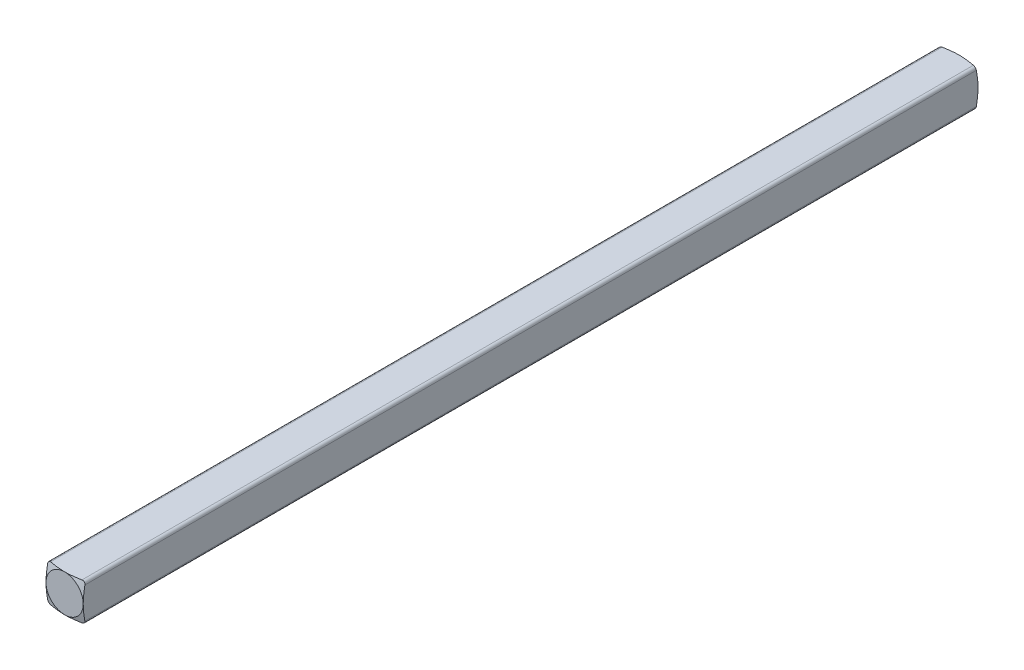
from build123d import *

# Parameters (mm, degrees)
SKETCH1_W      = 3.17
SKETCH1_H      = 3.17
EXTRUDE1_DEPTH = 38.1
FILLET1_R      = 0.25


with BuildPart() as part:
    # Sketch1 → Extrude1 (new, symmetric)
    with BuildSketch(Plane.XY):
        with Locations((0.050122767, 0)):
            Rectangle(SKETCH1_W, SKETCH1_H)
    extrude(amount=EXTRUDE1_DEPTH, both=True)

    # Sketch4 → Cut-Revolve3 (revolve, cut)
    with BuildSketch(Plane.XZ):
        Polygon((1.635122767, 38.1), (2.555122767, 38.1), (2.555122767, 37.83), align=None)
    cut_revolve3 = revolve(axis=Axis((0.050122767, 0, -38.1), (0, 0, 1)), mode=Mode.SUBTRACT)

    # Mirror2: Cut-Revolve3 across plane
    add(cut_revolve3.mirror(Plane.XY), mode=Mode.SUBTRACT)

    # Fillet1
    fillet1_edges = [part.edges().sort_by_distance(p)[0] for p in [
        (1.635122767, 1.585, 0),
        (1.635122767, -1.585, 0),
        (-1.534877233, -1.585, 0),
        (-1.534877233, 1.585, 0),
    ]]
    fillet(fillet1_edges, radius=FILLET1_R)


solid = part.part
